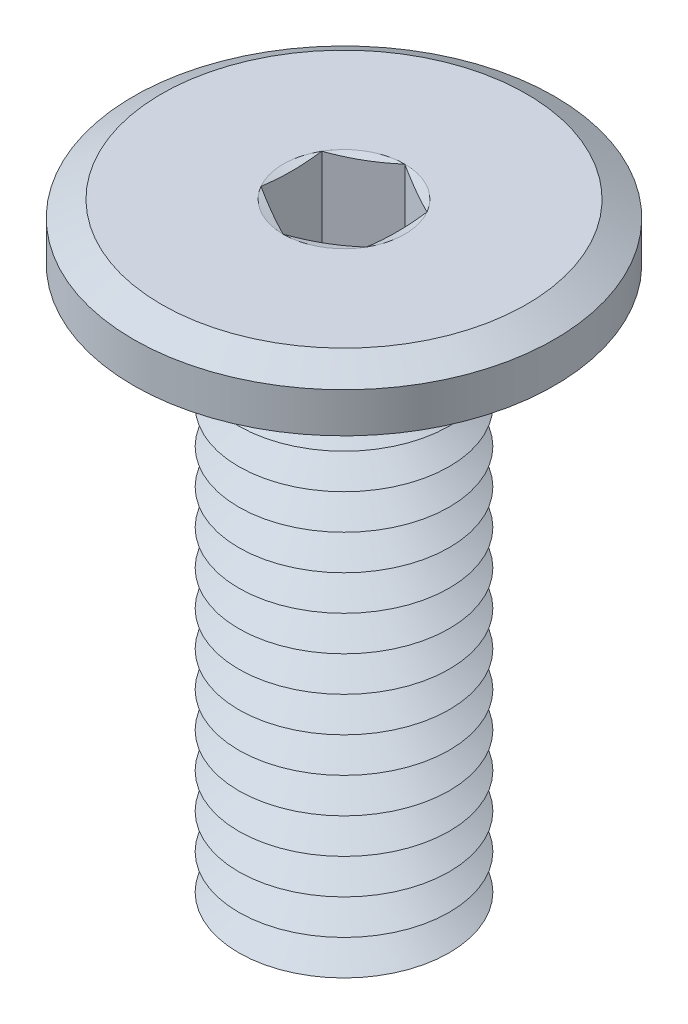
from build123d import *

# Parameters (mm, degrees)
SKETCH1_R           = 3
BOSS_EXTRUDE1_DEPTH = 0.8
SKETCH2_R           = 1.5
BOSS_EXTRUDE2_DEPTH = 8
LPATTERN1_COUNT     = 15
LPATTERN1_PITCH     = 0.5
FILLET1_R           = 0.1
CHAMFER2_SIZE       = 0.4
CHAMFER2_SIZE2      = 0.230940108
CUT_EXTRUDE1_DEPTH  = 1.4


with BuildPart() as part:
    # Sketch1 → Boss-Extrude1 (new body)
    with BuildSketch(Plane(origin=(0, 0, 0), x_dir=(1, 0, 0), z_dir=(0, 1, 0))):
        with Locations(Location((0, 0, 0), (0, 0, 270))):
            Circle(SKETCH1_R)
    extrude(amount=-BOSS_EXTRUDE1_DEPTH)

    # Sketch2 → Boss-Extrude2 (add)
    with BuildSketch(Plane.XZ.offset(0.8)):
        with Locations(Location((0, 0, 0), (0, 0, 270))):
            Circle(SKETCH2_R)
    extrude(amount=BOSS_EXTRUDE2_DEPTH)

    # Sketch5 → Cut-Revolve1 (revolve, cut)
    with BuildSketch(Plane(origin=(0, 0, 0), x_dir=(0, 0, -1), z_dir=(1, 0, 0))):
        Polygon((-1.5, -9.05), (-1.066987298, -8.8), (-1.5, -8.55), align=None)
    cut_revolve1 = revolve(axis=Axis((0, 0.990593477, 0), (0, -1, 0)), mode=Mode.SUBTRACT)

    # LPattern1: Cut-Revolve1 ×15
    with Locations(*[(0, i * LPATTERN1_PITCH, 0) for i in range(1, LPATTERN1_COUNT)]):
        add(cut_revolve1, mode=Mode.SUBTRACT)

    # Fillet1
    fillet1_edges = [part.edges().sort_by_distance(p)[0] for p in [
        (0, -0.8, 1.5),
    ]]
    fillet(fillet1_edges, radius=FILLET1_R)

    # Chamfer2
    chamfer2_edges = [part.edges().sort_by_distance(p)[0] for p in [
        (0, 0, -3),
    ]]
    chamfer2_side = [part.faces().sort_by_distance(p)[0] for p in [
        (0, 0, 0),
    ]]
    chamfer(chamfer2_edges, length=CHAMFER2_SIZE, length2=CHAMFER2_SIZE2, reference=chamfer2_side[0])

    # Sketch6 → Cut-Extrude1 (cut)
    with BuildSketch(Plane(origin=(0, 0, 0), x_dir=(1, 0, 0), z_dir=(0, 1, 0))):
        Polygon((0, 0.866025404), (-0.75, 0.433012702), (-0.75, -0.433012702), (0, -0.866025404), (0.75, -0.433012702), (0.75, 0.433012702), align=None)
    extrude(amount=-CUT_EXTRUDE1_DEPTH, mode=Mode.SUBTRACT)

    # Cut-Extrude2 cone 1 section (on through the dimple's axis) → Cut-Extrude2 (revolve, cut)
    with BuildSketch(Plane(origin=(0, -1.4, 0), x_dir=(0, 0, 1), z_dir=(1, 0, 0))):
        Polygon((0, 0), (0.75, 0), (0, 0.433012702), align=None)
    revolve(axis=Axis((0, -1.4, 0), (0, -1, 0)), mode=Mode.SUBTRACT)

    # Cut-Extrude3 cone 1 section (on through the dimple's axis) → Cut-Extrude3 (revolve, cut)
    with BuildSketch(Plane(origin=(0, 0, 0), x_dir=(0, 0, 1), z_dir=(1, 0, 0))):
        Polygon((0, 0), (0.866025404, 0), (0, 0.232050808), align=None)
    revolve(axis=Axis((0, 0, 0), (0, -1, 0)), mode=Mode.SUBTRACT)


solid = part.part
